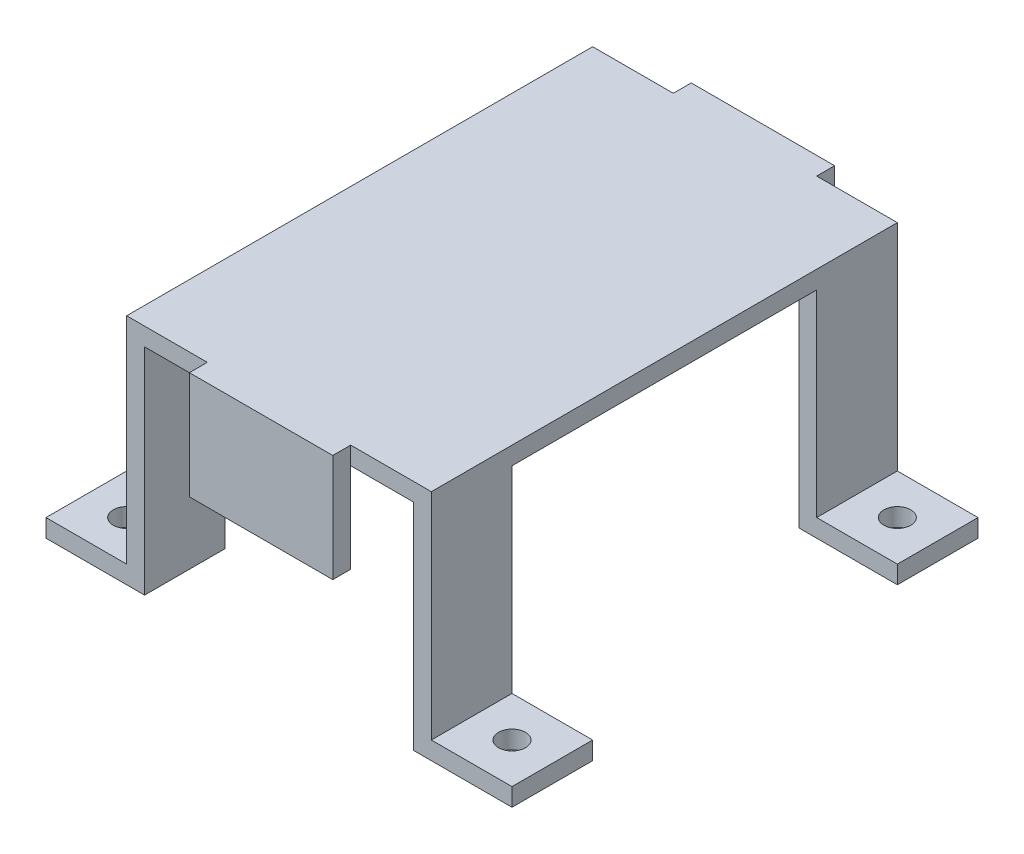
ISO-10303-21;
HEADER;
FILE_DESCRIPTION(('STEP AP214'),'2;1');
FILE_NAME('part.step','',(''),(''),'','','');
FILE_SCHEMA(('AUTOMOTIVE_DESIGN { 1 0 10303 214 1 1 1 1 }'));
ENDSEC;
DATA;
#1=APPLICATION_CONTEXT('core data for automotive mechanical design processes');
#2=APPLICATION_PROTOCOL_DEFINITION('international standard','automotive_design',2000,#1);
#3=PRODUCT_CONTEXT('',#1,'mechanical');
#4=PRODUCT('Part','Part','',(#3));
#5=PRODUCT_RELATED_PRODUCT_CATEGORY('part','',(#4));
#6=PRODUCT_DEFINITION_FORMATION('','',#4);
#7=PRODUCT_DEFINITION_CONTEXT('part definition',#1,'design');
#8=PRODUCT_DEFINITION('design','',#6,#7);
#9=PRODUCT_DEFINITION_SHAPE('','',#8);
#10=(LENGTH_UNIT() NAMED_UNIT(*) SI_UNIT(.MILLI.,.METRE.));
#11=(NAMED_UNIT(*) PLANE_ANGLE_UNIT() SI_UNIT($,.RADIAN.));
#12=(NAMED_UNIT(*) SI_UNIT($,.STERADIAN.) SOLID_ANGLE_UNIT());
#13=UNCERTAINTY_MEASURE_WITH_UNIT(LENGTH_MEASURE(1.E-05),#10,'distance_accuracy_value','');
#14=(GEOMETRIC_REPRESENTATION_CONTEXT(3) GLOBAL_UNCERTAINTY_ASSIGNED_CONTEXT((#13)) GLOBAL_UNIT_ASSIGNED_CONTEXT((#10,
#11,#12)) REPRESENTATION_CONTEXT('',''));
#15=CARTESIAN_POINT('',(0.,0.,0.));
#16=DIRECTION('',(0.,0.,1.));
#17=DIRECTION('',(1.,0.,0.));
#18=AXIS2_PLACEMENT_3D('',#15,#16,#17);
#19=CARTESIAN_POINT('',(0.,24.,0.));
#20=DIRECTION('',(0.,-1.,0.));
#21=DIRECTION('',(0.,0.,-1.));
#22=AXIS2_PLACEMENT_3D('',#19,#20,#21);
#23=PLANE('',#22);
#24=DIRECTION('',(1.,0.,0.));
#25=VECTOR('',#24,1.);
#26=CARTESIAN_POINT('',(11.,24.,-52.));
#27=LINE('',#26,#25);
#28=CARTESIAN_POINT('',(11.,24.,-52.));
#29=VERTEX_POINT('',#28);
#30=CARTESIAN_POINT('',(18.,24.,-52.));
#31=VERTEX_POINT('',#30);
#32=EDGE_CURVE('E442',#29,#31,#27,.T.);
#33=ORIENTED_EDGE('',*,*,#32,.T.);
#34=DIRECTION('',(-1.,0.,0.));
#35=VECTOR('',#34,1.);
#36=CARTESIAN_POINT('',(34.,24.,-52.));
#37=LINE('',#36,#35);
#38=CARTESIAN_POINT('',(34.,24.,-52.));
#39=VERTEX_POINT('',#38);
#40=EDGE_CURVE('E293',#39,#31,#37,.T.);
#41=ORIENTED_EDGE('',*,*,#40,.F.);
#42=CARTESIAN_POINT('',(41.,24.,-52.));
#43=VERTEX_POINT('',#42);
#44=EDGE_CURVE('E449',#39,#43,#27,.T.);
#45=ORIENTED_EDGE('',*,*,#44,.T.);
#46=DIRECTION('',(0.,0.,1.));
#47=VECTOR('',#46,1.);
#48=CARTESIAN_POINT('',(41.,24.,0.));
#49=LINE('',#48,#47);
#50=CARTESIAN_POINT('',(41.,24.,-43.));
#51=VERTEX_POINT('',#50);
#52=EDGE_CURVE('E452',#43,#51,#49,.T.);
#53=ORIENTED_EDGE('',*,*,#52,.T.);
#54=DIRECTION('',(1.,0.,0.));
#55=VECTOR('',#54,1.);
#56=CARTESIAN_POINT('',(0.,24.,-43.));
#57=LINE('',#56,#55);
#58=CARTESIAN_POINT('',(43.,24.,-43.));
#59=VERTEX_POINT('',#58);
#60=EDGE_CURVE('E393',#51,#59,#57,.T.);
#61=ORIENTED_EDGE('',*,*,#60,.T.);
#62=DIRECTION('',(0.,0.,-1.));
#63=VECTOR('',#62,1.);
#64=CARTESIAN_POINT('',(43.,24.,0.));
#65=LINE('',#64,#63);
#66=CARTESIAN_POINT('',(43.,24.,-9.));
#67=VERTEX_POINT('',#66);
#68=EDGE_CURVE('E12',#67,#59,#65,.T.);
#69=ORIENTED_EDGE('',*,*,#68,.F.);
#70=DIRECTION('',(1.,0.,0.));
#71=VECTOR('',#70,1.);
#72=CARTESIAN_POINT('',(0.,24.,-9.));
#73=LINE('',#72,#71);
#74=CARTESIAN_POINT('',(41.,24.,-9.));
#75=VERTEX_POINT('',#74);
#76=EDGE_CURVE('E387',#75,#67,#73,.T.);
#77=ORIENTED_EDGE('',*,*,#76,.F.);
#78=CARTESIAN_POINT('',(41.,24.,0.));
#79=VERTEX_POINT('',#78);
#80=EDGE_CURVE('E448',#75,#79,#49,.T.);
#81=ORIENTED_EDGE('',*,*,#80,.T.);
#82=DIRECTION('',(-1.,0.,0.));
#83=VECTOR('',#82,1.);
#84=CARTESIAN_POINT('',(11.,24.,0.));
#85=LINE('',#84,#83);
#86=CARTESIAN_POINT('',(34.,24.,0.));
#87=VERTEX_POINT('',#86);
#88=EDGE_CURVE('E457',#79,#87,#85,.T.);
#89=ORIENTED_EDGE('',*,*,#88,.T.);
#90=DIRECTION('',(1.,0.,0.));
#91=VECTOR('',#90,1.);
#92=CARTESIAN_POINT('',(34.,24.,0.));
#93=LINE('',#92,#91);
#94=CARTESIAN_POINT('',(18.,24.,0.));
#95=VERTEX_POINT('',#94);
#96=EDGE_CURVE('E325',#95,#87,#93,.T.);
#97=ORIENTED_EDGE('',*,*,#96,.F.);
#98=CARTESIAN_POINT('',(11.,24.,0.));
#99=VERTEX_POINT('',#98);
#100=EDGE_CURVE('E456',#95,#99,#85,.T.);
#101=ORIENTED_EDGE('',*,*,#100,.T.);
#102=DIRECTION('',(0.,0.,-1.));
#103=VECTOR('',#102,1.);
#104=CARTESIAN_POINT('',(11.,24.,0.));
#105=LINE('',#104,#103);
#106=CARTESIAN_POINT('',(11.,24.,-9.));
#107=VERTEX_POINT('',#106);
#108=EDGE_CURVE('E450',#99,#107,#105,.T.);
#109=ORIENTED_EDGE('',*,*,#108,.T.);
#110=CARTESIAN_POINT('',(9.,24.,-9.));
#111=VERTEX_POINT('',#110);
#112=EDGE_CURVE('E391',#111,#107,#73,.T.);
#113=ORIENTED_EDGE('',*,*,#112,.F.);
#114=DIRECTION('',(0.,0.,1.));
#115=VECTOR('',#114,1.);
#116=CARTESIAN_POINT('',(9.,24.,-52.));
#117=LINE('',#116,#115);
#118=CARTESIAN_POINT('',(9.,24.,-43.));
#119=VERTEX_POINT('',#118);
#120=EDGE_CURVE('E425',#119,#111,#117,.T.);
#121=ORIENTED_EDGE('',*,*,#120,.F.);
#122=CARTESIAN_POINT('',(11.,24.,-43.));
#123=VERTEX_POINT('',#122);
#124=EDGE_CURVE('E392',#119,#123,#57,.T.);
#125=ORIENTED_EDGE('',*,*,#124,.T.);
#126=EDGE_CURVE('E472',#123,#29,#105,.T.);
#127=ORIENTED_EDGE('',*,*,#126,.T.);
#128=EDGE_LOOP('',(#33,#41,#45,#53,#61,#69,#77,#81,#89,#97,#101,#109,#113,#121,#125,#127));
#129=FACE_BOUND('',#128,.T.);
#130=ADVANCED_FACE('F46',(#129),#23,.T.);
#131=CARTESIAN_POINT('',(0.,26.,-52.));
#132=DIRECTION('',(0.,0.,-1.));
#133=DIRECTION('',(-1.,0.,0.));
#134=AXIS2_PLACEMENT_3D('',#131,#132,#133);
#135=PLANE('',#134);
#136=DIRECTION('',(0.,-1.,0.));
#137=VECTOR('',#136,1.);
#138=CARTESIAN_POINT('',(34.,26.,-52.));
#139=LINE('',#138,#137);
#140=CARTESIAN_POINT('',(34.,26.,-52.));
#141=VERTEX_POINT('',#140);
#142=EDGE_CURVE('E62',#141,#39,#139,.T.);
#143=ORIENTED_EDGE('',*,*,#142,.F.);
#144=DIRECTION('',(1.,0.,0.));
#145=VECTOR('',#144,1.);
#146=CARTESIAN_POINT('',(0.,26.,-52.));
#147=LINE('',#146,#145);
#148=CARTESIAN_POINT('',(43.,26.,-52.));
#149=VERTEX_POINT('',#148);
#150=EDGE_CURVE('E491',#141,#149,#147,.T.);
#151=ORIENTED_EDGE('',*,*,#150,.T.);
#152=DIRECTION('',(0.,1.,0.));
#153=VECTOR('',#152,1.);
#154=CARTESIAN_POINT('',(43.,2.,-52.));
#155=LINE('',#154,#153);
#156=CARTESIAN_POINT('',(43.,2.,-52.));
#157=VERTEX_POINT('',#156);
#158=EDGE_CURVE('E671',#157,#149,#155,.T.);
#159=ORIENTED_EDGE('',*,*,#158,.F.);
#160=DIRECTION('',(-1.,0.,0.));
#161=VECTOR('',#160,1.);
#162=CARTESIAN_POINT('',(52.,2.,-52.));
#163=LINE('',#162,#161);
#164=CARTESIAN_POINT('',(52.,2.,-52.));
#165=VERTEX_POINT('',#164);
#166=EDGE_CURVE('E656',#165,#157,#163,.T.);
#167=ORIENTED_EDGE('',*,*,#166,.F.);
#168=DIRECTION('',(0.,-1.,0.));
#169=VECTOR('',#168,1.);
#170=CARTESIAN_POINT('',(52.,26.,-52.));
#171=LINE('',#170,#169);
#172=CARTESIAN_POINT('',(52.,0.,-52.));
#173=VERTEX_POINT('',#172);
#174=EDGE_CURVE('E624',#165,#173,#171,.T.);
#175=ORIENTED_EDGE('',*,*,#174,.T.);
#176=DIRECTION('',(1.,0.,0.));
#177=VECTOR('',#176,1.);
#178=CARTESIAN_POINT('',(0.,0.,-52.));
#179=LINE('',#178,#177);
#180=CARTESIAN_POINT('',(41.,0.,-52.));
#181=VERTEX_POINT('',#180);
#182=EDGE_CURVE('E500',#181,#173,#179,.T.);
#183=ORIENTED_EDGE('',*,*,#182,.F.);
#184=DIRECTION('',(0.,-1.,0.));
#185=VECTOR('',#184,1.);
#186=CARTESIAN_POINT('',(41.,24.,-52.));
#187=LINE('',#186,#185);
#188=EDGE_CURVE('E481',#43,#181,#187,.T.);
#189=ORIENTED_EDGE('',*,*,#188,.F.);
#190=ORIENTED_EDGE('',*,*,#44,.F.);
#191=EDGE_LOOP('',(#143,#151,#159,#167,#175,#183,#189,#190));
#192=FACE_BOUND('',#191,.T.);
#193=ADVANCED_FACE('F556',(#192),#135,.T.);
#194=CARTESIAN_POINT('',(0.,26.,0.));
#195=DIRECTION('',(0.,0.,-1.));
#196=DIRECTION('',(-1.,0.,0.));
#197=AXIS2_PLACEMENT_3D('',#194,#195,#196);
#198=PLANE('',#197);
#199=DIRECTION('',(0.,-1.,0.));
#200=VECTOR('',#199,1.);
#201=CARTESIAN_POINT('',(18.,26.,0.));
#202=LINE('',#201,#200);
#203=CARTESIAN_POINT('',(18.,26.,0.));
#204=VERTEX_POINT('',#203);
#205=EDGE_CURVE('E70',#204,#95,#202,.T.);
#206=ORIENTED_EDGE('',*,*,#205,.F.);
#207=DIRECTION('',(1.,0.,0.));
#208=VECTOR('',#207,1.);
#209=CARTESIAN_POINT('',(0.,26.,0.));
#210=LINE('',#209,#208);
#211=CARTESIAN_POINT('',(9.,26.,0.));
#212=VERTEX_POINT('',#211);
#213=EDGE_CURVE('E492',#212,#204,#210,.T.);
#214=ORIENTED_EDGE('',*,*,#213,.F.);
#215=DIRECTION('',(0.,1.,0.));
#216=VECTOR('',#215,1.);
#217=CARTESIAN_POINT('',(9.00000000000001,2.,0.));
#218=LINE('',#217,#216);
#219=CARTESIAN_POINT('',(9.00000000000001,2.,0.));
#220=VERTEX_POINT('',#219);
#221=EDGE_CURVE('E698',#220,#212,#218,.T.);
#222=ORIENTED_EDGE('',*,*,#221,.F.);
#223=DIRECTION('',(1.,0.,0.));
#224=VECTOR('',#223,1.);
#225=CARTESIAN_POINT('',(0.,2.,0.));
#226=LINE('',#225,#224);
#227=CARTESIAN_POINT('',(0.,2.,0.));
#228=VERTEX_POINT('',#227);
#229=EDGE_CURVE('E685',#228,#220,#226,.T.);
#230=ORIENTED_EDGE('',*,*,#229,.F.);
#231=DIRECTION('',(0.,-1.,0.));
#232=VECTOR('',#231,1.);
#233=CARTESIAN_POINT('',(0.,26.,0.));
#234=LINE('',#233,#232);
#235=CARTESIAN_POINT('',(0.,0.,0.));
#236=VERTEX_POINT('',#235);
#237=EDGE_CURVE('E634',#228,#236,#234,.T.);
#238=ORIENTED_EDGE('',*,*,#237,.T.);
#239=DIRECTION('',(1.,0.,0.));
#240=VECTOR('',#239,1.);
#241=CARTESIAN_POINT('',(0.,0.,0.));
#242=LINE('',#241,#240);
#243=CARTESIAN_POINT('',(11.,0.,0.));
#244=VERTEX_POINT('',#243);
#245=EDGE_CURVE('E723',#236,#244,#242,.T.);
#246=ORIENTED_EDGE('',*,*,#245,.T.);
#247=DIRECTION('',(0.,-1.,0.));
#248=VECTOR('',#247,1.);
#249=CARTESIAN_POINT('',(11.,24.,0.));
#250=LINE('',#249,#248);
#251=EDGE_CURVE('E473',#99,#244,#250,.T.);
#252=ORIENTED_EDGE('',*,*,#251,.F.);
#253=ORIENTED_EDGE('',*,*,#100,.F.);
#254=EDGE_LOOP('',(#206,#214,#222,#230,#238,#246,#252,#253));
#255=FACE_BOUND('',#254,.T.);
#256=ADVANCED_FACE('F564',(#255),#198,.F.);
#257=DIRECTION('',(0.,1.,0.));
#258=VECTOR('',#257,1.);
#259=CARTESIAN_POINT('',(34.,26.,0.));
#260=LINE('',#259,#258);
#261=CARTESIAN_POINT('',(34.,26.,0.));
#262=VERTEX_POINT('',#261);
#263=EDGE_CURVE('E353',#87,#262,#260,.T.);
#264=ORIENTED_EDGE('',*,*,#263,.F.);
#265=ORIENTED_EDGE('',*,*,#88,.F.);
#266=DIRECTION('',(0.,-1.,0.));
#267=VECTOR('',#266,1.);
#268=CARTESIAN_POINT('',(41.,24.,0.));
#269=LINE('',#268,#267);
#270=CARTESIAN_POINT('',(41.,0.,0.));
#271=VERTEX_POINT('',#270);
#272=EDGE_CURVE('E477',#79,#271,#269,.T.);
#273=ORIENTED_EDGE('',*,*,#272,.T.);
#274=CARTESIAN_POINT('',(52.,0.,0.));
#275=VERTEX_POINT('',#274);
#276=EDGE_CURVE('E726',#271,#275,#242,.T.);
#277=ORIENTED_EDGE('',*,*,#276,.T.);
#278=DIRECTION('',(0.,-1.,0.));
#279=VECTOR('',#278,1.);
#280=CARTESIAN_POINT('',(52.,26.,0.));
#281=LINE('',#280,#279);
#282=CARTESIAN_POINT('',(52.,2.,0.));
#283=VERTEX_POINT('',#282);
#284=EDGE_CURVE('E628',#283,#275,#281,.T.);
#285=ORIENTED_EDGE('',*,*,#284,.F.);
#286=DIRECTION('',(1.,0.,0.));
#287=VECTOR('',#286,1.);
#288=CARTESIAN_POINT('',(52.,2.,0.));
#289=LINE('',#288,#287);
#290=CARTESIAN_POINT('',(43.,2.,0.));
#291=VERTEX_POINT('',#290);
#292=EDGE_CURVE('E654',#291,#283,#289,.T.);
#293=ORIENTED_EDGE('',*,*,#292,.F.);
#294=DIRECTION('',(0.,1.,0.));
#295=VECTOR('',#294,1.);
#296=CARTESIAN_POINT('',(43.,2.,0.));
#297=LINE('',#296,#295);
#298=CARTESIAN_POINT('',(43.,26.,0.));
#299=VERTEX_POINT('',#298);
#300=EDGE_CURVE('E676',#291,#299,#297,.T.);
#301=ORIENTED_EDGE('',*,*,#300,.T.);
#302=EDGE_CURVE('E490',#262,#299,#210,.T.);
#303=ORIENTED_EDGE('',*,*,#302,.F.);
#304=EDGE_LOOP('',(#264,#265,#273,#277,#285,#293,#301,#303));
#305=FACE_BOUND('',#304,.T.);
#306=ADVANCED_FACE('F586',(#305),#198,.F.);
#307=CARTESIAN_POINT('',(0.,26.,0.));
#308=DIRECTION('',(-1.,0.,0.));
#309=DIRECTION('',(0.,0.,1.));
#310=AXIS2_PLACEMENT_3D('',#307,#308,#309);
#311=PLANE('',#310);
#312=DIRECTION('',(0.,-1.,0.));
#313=VECTOR('',#312,1.);
#314=CARTESIAN_POINT('',(0.,0.,-9.));
#315=LINE('',#314,#313);
#316=CARTESIAN_POINT('',(0.,2.,-9.));
#317=VERTEX_POINT('',#316);
#318=CARTESIAN_POINT('',(0.,0.,-9.));
#319=VERTEX_POINT('',#318);
#320=EDGE_CURVE('E373',#317,#319,#315,.T.);
#321=ORIENTED_EDGE('',*,*,#320,.T.);
#322=DIRECTION('',(0.,0.,-1.));
#323=VECTOR('',#322,1.);
#324=CARTESIAN_POINT('',(0.,0.,0.));
#325=LINE('',#324,#323);
#326=EDGE_CURVE('E496',#236,#319,#325,.T.);
#327=ORIENTED_EDGE('',*,*,#326,.F.);
#328=ORIENTED_EDGE('',*,*,#237,.F.);
#329=DIRECTION('',(0.,0.,1.));
#330=VECTOR('',#329,1.);
#331=CARTESIAN_POINT('',(0.,2.,-52.));
#332=LINE('',#331,#330);
#333=EDGE_CURVE('E686',#317,#228,#332,.T.);
#334=ORIENTED_EDGE('',*,*,#333,.F.);
#335=EDGE_LOOP('',(#321,#327,#328,#334));
#336=FACE_BOUND('',#335,.T.);
#337=ADVANCED_FACE('F829',(#336),#311,.T.);
#338=CARTESIAN_POINT('',(52.,26.,0.));
#339=DIRECTION('',(-1.,0.,0.));
#340=DIRECTION('',(0.,0.,1.));
#341=AXIS2_PLACEMENT_3D('',#338,#339,#340);
#342=PLANE('',#341);
#343=DIRECTION('',(0.,0.,-1.));
#344=VECTOR('',#343,1.);
#345=CARTESIAN_POINT('',(52.,0.,0.));
#346=LINE('',#345,#344);
#347=CARTESIAN_POINT('',(52.,0.,-9.));
#348=VERTEX_POINT('',#347);
#349=EDGE_CURVE('E507',#275,#348,#346,.T.);
#350=ORIENTED_EDGE('',*,*,#349,.T.);
#351=DIRECTION('',(0.,-1.,0.));
#352=VECTOR('',#351,1.);
#353=CARTESIAN_POINT('',(52.,0.,-9.));
#354=LINE('',#353,#352);
#355=CARTESIAN_POINT('',(52.,2.,-9.));
#356=VERTEX_POINT('',#355);
#357=EDGE_CURVE('E372',#356,#348,#354,.T.);
#358=ORIENTED_EDGE('',*,*,#357,.F.);
#359=DIRECTION('',(0.,0.,-1.));
#360=VECTOR('',#359,1.);
#361=CARTESIAN_POINT('',(52.,2.,0.));
#362=LINE('',#361,#360);
#363=EDGE_CURVE('E649',#283,#356,#362,.T.);
#364=ORIENTED_EDGE('',*,*,#363,.F.);
#365=ORIENTED_EDGE('',*,*,#284,.T.);
#366=EDGE_LOOP('',(#350,#358,#364,#365));
#367=FACE_BOUND('',#366,.T.);
#368=ADVANCED_FACE('F590',(#367),#342,.F.);
#369=CARTESIAN_POINT('',(0.,0.,0.));
#370=DIRECTION('',(0.,-1.,0.));
#371=DIRECTION('',(0.,0.,-1.));
#372=AXIS2_PLACEMENT_3D('',#369,#370,#371);
#373=PLANE('',#372);
#374=DIRECTION('',(1.,0.,0.));
#375=VECTOR('',#374,1.);
#376=CARTESIAN_POINT('',(0.,0.,-9.));
#377=LINE('',#376,#375);
#378=CARTESIAN_POINT('',(11.,0.,-9.));
#379=VERTEX_POINT('',#378);
#380=EDGE_CURVE('E401',#319,#379,#377,.T.);
#381=ORIENTED_EDGE('',*,*,#380,.T.);
#382=DIRECTION('',(0.,0.,-1.));
#383=VECTOR('',#382,1.);
#384=CARTESIAN_POINT('',(11.,0.,0.));
#385=LINE('',#384,#383);
#386=EDGE_CURVE('E461',#244,#379,#385,.T.);
#387=ORIENTED_EDGE('',*,*,#386,.F.);
#388=ORIENTED_EDGE('',*,*,#245,.F.);
#389=ORIENTED_EDGE('',*,*,#326,.T.);
#390=EDGE_LOOP('',(#381,#387,#388,#389));
#391=FACE_BOUND('',#390,.T.);
#392=CARTESIAN_POINT('',(4.5,0.,-4.5));
#393=DIRECTION('',(0.,1.,0.));
#394=DIRECTION('',(0.,0.,1.));
#395=AXIS2_PLACEMENT_3D('',#392,#393,#394);
#396=CIRCLE('',#395,1.5);
#397=CARTESIAN_POINT('',(4.5,0.,-3.));
#398=VERTEX_POINT('',#397);
#399=EDGE_CURVE('E414',#398,#398,#396,.T.);
#400=ORIENTED_EDGE('',*,*,#399,.T.);
#401=EDGE_LOOP('',(#400));
#402=FACE_BOUND('',#401,.T.);
#403=ADVANCED_FACE('F582',(#391,#402),#373,.T.);
#404=CARTESIAN_POINT('',(41.,0.,-9.));
#405=VERTEX_POINT('',#404);
#406=EDGE_CURVE('E382',#405,#348,#377,.T.);
#407=ORIENTED_EDGE('',*,*,#406,.T.);
#408=ORIENTED_EDGE('',*,*,#349,.F.);
#409=ORIENTED_EDGE('',*,*,#276,.F.);
#410=DIRECTION('',(0.,0.,1.));
#411=VECTOR('',#410,1.);
#412=CARTESIAN_POINT('',(41.,0.,0.));
#413=LINE('',#412,#411);
#414=EDGE_CURVE('E465',#405,#271,#413,.T.);
#415=ORIENTED_EDGE('',*,*,#414,.F.);
#416=EDGE_LOOP('',(#407,#408,#409,#415));
#417=FACE_BOUND('',#416,.T.);
#418=CARTESIAN_POINT('',(47.5,0.,-4.5));
#419=DIRECTION('',(0.,1.,0.));
#420=DIRECTION('',(0.,0.,1.));
#421=AXIS2_PLACEMENT_3D('',#418,#419,#420);
#422=CIRCLE('',#421,1.5);
#423=CARTESIAN_POINT('',(47.5,0.,-2.99999999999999));
#424=VERTEX_POINT('',#423);
#425=EDGE_CURVE('E426',#424,#424,#422,.T.);
#426=ORIENTED_EDGE('',*,*,#425,.T.);
#427=EDGE_LOOP('',(#426));
#428=FACE_BOUND('',#427,.T.);
#429=ADVANCED_FACE('F598',(#417,#428),#373,.T.);
#430=CARTESIAN_POINT('',(11.,24.,0.));
#431=DIRECTION('',(-1.,0.,0.));
#432=DIRECTION('',(0.,0.,1.));
#433=AXIS2_PLACEMENT_3D('',#430,#431,#432);
#434=PLANE('',#433);
#435=ORIENTED_EDGE('',*,*,#386,.T.);
#436=DIRECTION('',(0.,1.,0.));
#437=VECTOR('',#436,1.);
#438=CARTESIAN_POINT('',(11.,24.,-9.));
#439=LINE('',#438,#437);
#440=EDGE_CURVE('E847',#379,#107,#439,.T.);
#441=ORIENTED_EDGE('',*,*,#440,.T.);
#442=ORIENTED_EDGE('',*,*,#108,.F.);
#443=ORIENTED_EDGE('',*,*,#251,.T.);
#444=EDGE_LOOP('',(#435,#441,#442,#443));
#445=FACE_BOUND('',#444,.T.);
#446=ADVANCED_FACE('F575',(#445),#434,.F.);
#447=CARTESIAN_POINT('',(41.,24.,0.));
#448=DIRECTION('',(1.,0.,0.));
#449=DIRECTION('',(0.,0.,-1.));
#450=AXIS2_PLACEMENT_3D('',#447,#448,#449);
#451=PLANE('',#450);
#452=ORIENTED_EDGE('',*,*,#80,.F.);
#453=DIRECTION('',(0.,-1.,0.));
#454=VECTOR('',#453,1.);
#455=CARTESIAN_POINT('',(41.,24.,-9.));
#456=LINE('',#455,#454);
#457=EDGE_CURVE('E856',#75,#405,#456,.T.);
#458=ORIENTED_EDGE('',*,*,#457,.T.);
#459=ORIENTED_EDGE('',*,*,#414,.T.);
#460=ORIENTED_EDGE('',*,*,#272,.F.);
#461=EDGE_LOOP('',(#452,#458,#459,#460));
#462=FACE_BOUND('',#461,.T.);
#463=ADVANCED_FACE('F553',(#462),#451,.F.);
#464=CARTESIAN_POINT('',(0.,2.,0.));
#465=DIRECTION('',(0.,1.,0.));
#466=DIRECTION('',(0.,0.,1.));
#467=AXIS2_PLACEMENT_3D('',#464,#465,#466);
#468=PLANE('',#467);
#469=DIRECTION('',(1.,0.,0.));
#470=VECTOR('',#469,1.);
#471=CARTESIAN_POINT('',(0.,2.,-9.));
#472=LINE('',#471,#470);
#473=CARTESIAN_POINT('',(9.00000000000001,2.,-9.));
#474=VERTEX_POINT('',#473);
#475=EDGE_CURVE('E863',#317,#474,#472,.T.);
#476=ORIENTED_EDGE('',*,*,#475,.F.);
#477=ORIENTED_EDGE('',*,*,#333,.T.);
#478=ORIENTED_EDGE('',*,*,#229,.T.);
#479=DIRECTION('',(0.,0.,-1.));
#480=VECTOR('',#479,1.);
#481=CARTESIAN_POINT('',(9.,2.,-52.));
#482=LINE('',#481,#480);
#483=EDGE_CURVE('E691',#220,#474,#482,.T.);
#484=ORIENTED_EDGE('',*,*,#483,.T.);
#485=EDGE_LOOP('',(#476,#477,#478,#484));
#486=FACE_BOUND('',#485,.T.);
#487=CARTESIAN_POINT('',(4.5,2.,-4.5));
#488=DIRECTION('',(0.,1.,0.));
#489=DIRECTION('',(0.,0.,1.));
#490=AXIS2_PLACEMENT_3D('',#487,#488,#489);
#491=CIRCLE('',#490,1.5);
#492=CARTESIAN_POINT('',(4.5,2.,-3.));
#493=VERTEX_POINT('',#492);
#494=EDGE_CURVE('E421',#493,#493,#491,.T.);
#495=ORIENTED_EDGE('',*,*,#494,.F.);
#496=EDGE_LOOP('',(#495));
#497=FACE_BOUND('',#496,.T.);
#498=ADVANCED_FACE('F539',(#486,#497),#468,.T.);
#499=CARTESIAN_POINT('',(0.,2.,0.));
#500=DIRECTION('',(0.,1.,0.));
#501=DIRECTION('',(0.,0.,1.));
#502=AXIS2_PLACEMENT_3D('',#499,#500,#501);
#503=PLANE('',#502);
#504=DIRECTION('',(1.,0.,0.));
#505=VECTOR('',#504,1.);
#506=CARTESIAN_POINT('',(0.,2.,-9.));
#507=LINE('',#506,#505);
#508=CARTESIAN_POINT('',(43.,2.,-9.));
#509=VERTEX_POINT('',#508);
#510=EDGE_CURVE('E55',#509,#356,#507,.T.);
#511=ORIENTED_EDGE('',*,*,#510,.F.);
#512=DIRECTION('',(0.,0.,1.));
#513=VECTOR('',#512,1.);
#514=CARTESIAN_POINT('',(43.,2.,0.));
#515=LINE('',#514,#513);
#516=EDGE_CURVE('E661',#509,#291,#515,.T.);
#517=ORIENTED_EDGE('',*,*,#516,.T.);
#518=ORIENTED_EDGE('',*,*,#292,.T.);
#519=ORIENTED_EDGE('',*,*,#363,.T.);
#520=EDGE_LOOP('',(#511,#517,#518,#519));
#521=FACE_BOUND('',#520,.T.);
#522=CARTESIAN_POINT('',(47.5,2.,-4.5));
#523=DIRECTION('',(0.,1.,0.));
#524=DIRECTION('',(0.,0.,1.));
#525=AXIS2_PLACEMENT_3D('',#522,#523,#524);
#526=CIRCLE('',#525,1.5);
#527=CARTESIAN_POINT('',(47.5,2.,-2.99999999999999));
#528=VERTEX_POINT('',#527);
#529=EDGE_CURVE('E432',#528,#528,#526,.T.);
#530=ORIENTED_EDGE('',*,*,#529,.F.);
#531=EDGE_LOOP('',(#530));
#532=FACE_BOUND('',#531,.T.);
#533=ADVANCED_FACE('F552',(#521,#532),#503,.T.);
#534=DIRECTION('',(0.,1.,0.));
#535=VECTOR('',#534,1.);
#536=CARTESIAN_POINT('',(0.,0.,-43.));
#537=LINE('',#536,#535);
#538=CARTESIAN_POINT('',(0.,0.,-43.));
#539=VERTEX_POINT('',#538);
#540=CARTESIAN_POINT('',(0.,2.,-43.));
#541=VERTEX_POINT('',#540);
#542=EDGE_CURVE('E377',#539,#541,#537,.T.);
#543=ORIENTED_EDGE('',*,*,#542,.T.);
#544=CARTESIAN_POINT('',(0.,2.,-52.));
#545=VERTEX_POINT('',#544);
#546=EDGE_CURVE('E621',#545,#541,#332,.T.);
#547=ORIENTED_EDGE('',*,*,#546,.F.);
#548=DIRECTION('',(0.,-1.,0.));
#549=VECTOR('',#548,1.);
#550=CARTESIAN_POINT('',(0.,26.,-52.));
#551=LINE('',#550,#549);
#552=CARTESIAN_POINT('',(0.,0.,-52.));
#553=VERTEX_POINT('',#552);
#554=EDGE_CURVE('E495',#545,#553,#551,.T.);
#555=ORIENTED_EDGE('',*,*,#554,.T.);
#556=EDGE_CURVE('E476',#539,#553,#325,.T.);
#557=ORIENTED_EDGE('',*,*,#556,.F.);
#558=EDGE_LOOP('',(#543,#547,#555,#557));
#559=FACE_BOUND('',#558,.T.);
#560=ADVANCED_FACE('F48',(#559),#311,.T.);
#561=CARTESIAN_POINT('',(52.,2.,-43.));
#562=VERTEX_POINT('',#561);
#563=EDGE_CURVE('E657',#562,#165,#362,.T.);
#564=ORIENTED_EDGE('',*,*,#563,.F.);
#565=DIRECTION('',(0.,1.,0.));
#566=VECTOR('',#565,1.);
#567=CARTESIAN_POINT('',(52.,0.,-43.));
#568=LINE('',#567,#566);
#569=CARTESIAN_POINT('',(52.,0.,-43.));
#570=VERTEX_POINT('',#569);
#571=EDGE_CURVE('E378',#570,#562,#568,.T.);
#572=ORIENTED_EDGE('',*,*,#571,.F.);
#573=EDGE_CURVE('E506',#570,#173,#346,.T.);
#574=ORIENTED_EDGE('',*,*,#573,.T.);
#575=ORIENTED_EDGE('',*,*,#174,.F.);
#576=EDGE_LOOP('',(#564,#572,#574,#575));
#577=FACE_BOUND('',#576,.T.);
#578=ADVANCED_FACE('F587',(#577),#342,.F.);
#579=DIRECTION('',(1.,0.,0.));
#580=VECTOR('',#579,1.);
#581=CARTESIAN_POINT('',(0.,0.,-43.));
#582=LINE('',#581,#580);
#583=CARTESIAN_POINT('',(11.,0.,-43.));
#584=VERTEX_POINT('',#583);
#585=EDGE_CURVE('E397',#539,#584,#582,.T.);
#586=ORIENTED_EDGE('',*,*,#585,.F.);
#587=ORIENTED_EDGE('',*,*,#556,.T.);
#588=CARTESIAN_POINT('',(11.,0.,-52.));
#589=VERTEX_POINT('',#588);
#590=EDGE_CURVE('E501',#553,#589,#179,.T.);
#591=ORIENTED_EDGE('',*,*,#590,.T.);
#592=EDGE_CURVE('E466',#584,#589,#385,.T.);
#593=ORIENTED_EDGE('',*,*,#592,.F.);
#594=EDGE_LOOP('',(#586,#587,#591,#593));
#595=FACE_BOUND('',#594,.T.);
#596=CARTESIAN_POINT('',(4.5,0.,-47.5));
#597=DIRECTION('',(0.,1.,0.));
#598=DIRECTION('',(0.,0.,1.));
#599=AXIS2_PLACEMENT_3D('',#596,#597,#598);
#600=CIRCLE('',#599,1.5);
#601=CARTESIAN_POINT('',(4.5,0.,-46.));
#602=VERTEX_POINT('',#601);
#603=EDGE_CURVE('E521',#602,#602,#600,.T.);
#604=ORIENTED_EDGE('',*,*,#603,.T.);
#605=EDGE_LOOP('',(#604));
#606=FACE_BOUND('',#605,.T.);
#607=ADVANCED_FACE('F583',(#595,#606),#373,.T.);
#608=DIRECTION('',(0.,1.,0.));
#609=VECTOR('',#608,1.);
#610=CARTESIAN_POINT('',(18.,26.,-52.));
#611=LINE('',#610,#609);
#612=CARTESIAN_POINT('',(18.,26.,-52.));
#613=VERTEX_POINT('',#612);
#614=EDGE_CURVE('E301',#31,#613,#611,.T.);
#615=ORIENTED_EDGE('',*,*,#614,.F.);
#616=ORIENTED_EDGE('',*,*,#32,.F.);
#617=DIRECTION('',(0.,-1.,0.));
#618=VECTOR('',#617,1.);
#619=CARTESIAN_POINT('',(11.,24.,-52.));
#620=LINE('',#619,#618);
#621=EDGE_CURVE('E460',#29,#589,#620,.T.);
#622=ORIENTED_EDGE('',*,*,#621,.T.);
#623=ORIENTED_EDGE('',*,*,#590,.F.);
#624=ORIENTED_EDGE('',*,*,#554,.F.);
#625=DIRECTION('',(-1.,0.,0.));
#626=VECTOR('',#625,1.);
#627=CARTESIAN_POINT('',(0.,2.,-52.));
#628=LINE('',#627,#626);
#629=CARTESIAN_POINT('',(9.,2.,-52.));
#630=VERTEX_POINT('',#629);
#631=EDGE_CURVE('E695',#630,#545,#628,.T.);
#632=ORIENTED_EDGE('',*,*,#631,.F.);
#633=DIRECTION('',(0.,1.,0.));
#634=VECTOR('',#633,1.);
#635=CARTESIAN_POINT('',(9.,2.,-52.));
#636=LINE('',#635,#634);
#637=CARTESIAN_POINT('',(9.,26.,-52.));
#638=VERTEX_POINT('',#637);
#639=EDGE_CURVE('E675',#630,#638,#636,.T.);
#640=ORIENTED_EDGE('',*,*,#639,.T.);
#641=EDGE_CURVE('E487',#638,#613,#147,.T.);
#642=ORIENTED_EDGE('',*,*,#641,.T.);
#643=EDGE_LOOP('',(#615,#616,#622,#623,#624,#632,#640,#642));
#644=FACE_BOUND('',#643,.T.);
#645=ADVANCED_FACE('F565',(#644),#135,.T.);
#646=CARTESIAN_POINT('',(0.,26.,0.));
#647=DIRECTION('',(0.,-1.,0.));
#648=DIRECTION('',(0.,0.,-1.));
#649=AXIS2_PLACEMENT_3D('',#646,#647,#648);
#650=PLANE('',#649);
#651=ORIENTED_EDGE('',*,*,#213,.T.);
#652=DIRECTION('',(0.,0.,-1.));
#653=VECTOR('',#652,1.);
#654=CARTESIAN_POINT('',(18.,26.,2.));
#655=LINE('',#654,#653);
#656=CARTESIAN_POINT('',(18.,26.,2.));
#657=VERTEX_POINT('',#656);
#658=EDGE_CURVE('E359',#657,#204,#655,.T.);
#659=ORIENTED_EDGE('',*,*,#658,.F.);
#660=DIRECTION('',(-1.,0.,0.));
#661=VECTOR('',#660,1.);
#662=CARTESIAN_POINT('',(18.,26.,2.));
#663=LINE('',#662,#661);
#664=CARTESIAN_POINT('',(34.,26.,2.));
#665=VERTEX_POINT('',#664);
#666=EDGE_CURVE('E356',#665,#657,#663,.T.);
#667=ORIENTED_EDGE('',*,*,#666,.F.);
#668=DIRECTION('',(0.,0.,-1.));
#669=VECTOR('',#668,1.);
#670=CARTESIAN_POINT('',(34.,26.,2.));
#671=LINE('',#670,#669);
#672=EDGE_CURVE('E368',#665,#262,#671,.T.);
#673=ORIENTED_EDGE('',*,*,#672,.T.);
#674=ORIENTED_EDGE('',*,*,#302,.T.);
#675=DIRECTION('',(0.,0.,1.));
#676=VECTOR('',#675,1.);
#677=CARTESIAN_POINT('',(43.,26.,0.));
#678=LINE('',#677,#676);
#679=EDGE_CURVE('E663',#149,#299,#678,.T.);
#680=ORIENTED_EDGE('',*,*,#679,.F.);
#681=ORIENTED_EDGE('',*,*,#150,.F.);
#682=DIRECTION('',(0.,0.,1.));
#683=VECTOR('',#682,1.);
#684=CARTESIAN_POINT('',(34.,26.,-54.));
#685=LINE('',#684,#683);
#686=CARTESIAN_POINT('',(34.,26.,-54.));
#687=VERTEX_POINT('',#686);
#688=EDGE_CURVE('E314',#687,#141,#685,.T.);
#689=ORIENTED_EDGE('',*,*,#688,.F.);
#690=DIRECTION('',(1.,0.,0.));
#691=VECTOR('',#690,1.);
#692=CARTESIAN_POINT('',(34.,26.,-54.));
#693=LINE('',#692,#691);
#694=CARTESIAN_POINT('',(18.,26.,-54.));
#695=VERTEX_POINT('',#694);
#696=EDGE_CURVE('E312',#695,#687,#693,.T.);
#697=ORIENTED_EDGE('',*,*,#696,.F.);
#698=DIRECTION('',(0.,0.,1.));
#699=VECTOR('',#698,1.);
#700=CARTESIAN_POINT('',(18.,26.,-54.));
#701=LINE('',#700,#699);
#702=EDGE_CURVE('E321',#695,#613,#701,.T.);
#703=ORIENTED_EDGE('',*,*,#702,.T.);
#704=ORIENTED_EDGE('',*,*,#641,.F.);
#705=DIRECTION('',(0.,0.,-1.));
#706=VECTOR('',#705,1.);
#707=CARTESIAN_POINT('',(9.,26.,-52.));
#708=LINE('',#707,#706);
#709=EDGE_CURVE('E431',#212,#638,#708,.T.);
#710=ORIENTED_EDGE('',*,*,#709,.F.);
#711=EDGE_LOOP('',(#651,#659,#667,#673,#674,#680,#681,#689,#697,#703,#704,#710));
#712=FACE_BOUND('',#711,.T.);
#713=ADVANCED_FACE('F576',(#712),#650,.F.);
#714=CARTESIAN_POINT('',(41.,0.,-43.));
#715=VERTEX_POINT('',#714);
#716=EDGE_CURVE('E400',#715,#570,#582,.T.);
#717=ORIENTED_EDGE('',*,*,#716,.F.);
#718=EDGE_CURVE('E467',#181,#715,#413,.T.);
#719=ORIENTED_EDGE('',*,*,#718,.F.);
#720=ORIENTED_EDGE('',*,*,#182,.T.);
#721=ORIENTED_EDGE('',*,*,#573,.F.);
#722=EDGE_LOOP('',(#717,#719,#720,#721));
#723=FACE_BOUND('',#722,.T.);
#724=CARTESIAN_POINT('',(47.5,0.,-47.5));
#725=DIRECTION('',(0.,1.,0.));
#726=DIRECTION('',(0.,0.,1.));
#727=AXIS2_PLACEMENT_3D('',#724,#725,#726);
#728=CIRCLE('',#727,1.5);
#729=CARTESIAN_POINT('',(47.5,0.,-46.));
#730=VERTEX_POINT('',#729);
#731=EDGE_CURVE('E510',#730,#730,#728,.T.);
#732=ORIENTED_EDGE('',*,*,#731,.T.);
#733=EDGE_LOOP('',(#732));
#734=FACE_BOUND('',#733,.T.);
#735=ADVANCED_FACE('F573',(#723,#734),#373,.T.);
#736=ORIENTED_EDGE('',*,*,#126,.F.);
#737=DIRECTION('',(0.,-1.,0.));
#738=VECTOR('',#737,1.);
#739=CARTESIAN_POINT('',(11.,24.,-43.));
#740=LINE('',#739,#738);
#741=EDGE_CURVE('E868',#123,#584,#740,.T.);
#742=ORIENTED_EDGE('',*,*,#741,.T.);
#743=ORIENTED_EDGE('',*,*,#592,.T.);
#744=ORIENTED_EDGE('',*,*,#621,.F.);
#745=EDGE_LOOP('',(#736,#742,#743,#744));
#746=FACE_BOUND('',#745,.T.);
#747=ADVANCED_FACE('F569',(#746),#434,.F.);
#748=ORIENTED_EDGE('',*,*,#718,.T.);
#749=DIRECTION('',(0.,1.,0.));
#750=VECTOR('',#749,1.);
#751=CARTESIAN_POINT('',(41.,24.,-43.));
#752=LINE('',#751,#750);
#753=EDGE_CURVE('E870',#715,#51,#752,.T.);
#754=ORIENTED_EDGE('',*,*,#753,.T.);
#755=ORIENTED_EDGE('',*,*,#52,.F.);
#756=ORIENTED_EDGE('',*,*,#188,.T.);
#757=EDGE_LOOP('',(#748,#754,#755,#756));
#758=FACE_BOUND('',#757,.T.);
#759=ADVANCED_FACE('F547',(#758),#451,.F.);
#760=CARTESIAN_POINT('',(9.,2.,-52.));
#761=DIRECTION('',(1.,0.,0.));
#762=DIRECTION('',(0.,0.,-1.));
#763=AXIS2_PLACEMENT_3D('',#760,#761,#762);
#764=PLANE('',#763);
#765=ORIENTED_EDGE('',*,*,#120,.T.);
#766=DIRECTION('',(0.,-1.,0.));
#767=VECTOR('',#766,1.);
#768=CARTESIAN_POINT('',(9.00000000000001,2.,-9.));
#769=LINE('',#768,#767);
#770=EDGE_CURVE('E851',#111,#474,#769,.T.);
#771=ORIENTED_EDGE('',*,*,#770,.T.);
#772=ORIENTED_EDGE('',*,*,#483,.F.);
#773=ORIENTED_EDGE('',*,*,#221,.T.);
#774=ORIENTED_EDGE('',*,*,#709,.T.);
#775=ORIENTED_EDGE('',*,*,#639,.F.);
#776=CARTESIAN_POINT('',(9.,2.,-43.));
#777=VERTEX_POINT('',#776);
#778=EDGE_CURVE('E690',#777,#630,#482,.T.);
#779=ORIENTED_EDGE('',*,*,#778,.F.);
#780=DIRECTION('',(0.,1.,0.));
#781=VECTOR('',#780,1.);
#782=CARTESIAN_POINT('',(9.,2.,-43.));
#783=LINE('',#782,#781);
#784=EDGE_CURVE('E853',#777,#119,#783,.T.);
#785=ORIENTED_EDGE('',*,*,#784,.T.);
#786=EDGE_LOOP('',(#765,#771,#772,#773,#774,#775,#779,#785));
#787=FACE_BOUND('',#786,.T.);
#788=ADVANCED_FACE('F536',(#787),#764,.F.);
#789=DIRECTION('',(-1.,0.,0.));
#790=VECTOR('',#789,1.);
#791=CARTESIAN_POINT('',(0.,2.,-43.));
#792=LINE('',#791,#790);
#793=EDGE_CURVE('E876',#777,#541,#792,.T.);
#794=ORIENTED_EDGE('',*,*,#793,.F.);
#795=ORIENTED_EDGE('',*,*,#778,.T.);
#796=ORIENTED_EDGE('',*,*,#631,.T.);
#797=ORIENTED_EDGE('',*,*,#546,.T.);
#798=EDGE_LOOP('',(#794,#795,#796,#797));
#799=FACE_BOUND('',#798,.T.);
#800=CARTESIAN_POINT('',(4.5,2.,-47.5));
#801=DIRECTION('',(0.,1.,0.));
#802=DIRECTION('',(0.,0.,1.));
#803=AXIS2_PLACEMENT_3D('',#800,#801,#802);
#804=CIRCLE('',#803,1.5);
#805=CARTESIAN_POINT('',(4.5,2.,-46.));
#806=VERTEX_POINT('',#805);
#807=EDGE_CURVE('E420',#806,#806,#804,.T.);
#808=ORIENTED_EDGE('',*,*,#807,.F.);
#809=EDGE_LOOP('',(#808));
#810=FACE_BOUND('',#809,.T.);
#811=ADVANCED_FACE('F533',(#799,#810),#468,.T.);
#812=CARTESIAN_POINT('',(43.,2.,0.));
#813=DIRECTION('',(-1.,0.,0.));
#814=DIRECTION('',(0.,0.,1.));
#815=AXIS2_PLACEMENT_3D('',#812,#813,#814);
#816=PLANE('',#815);
#817=ORIENTED_EDGE('',*,*,#516,.F.);
#818=DIRECTION('',(0.,1.,0.));
#819=VECTOR('',#818,1.);
#820=CARTESIAN_POINT('',(43.,2.,-9.));
#821=LINE('',#820,#819);
#822=EDGE_CURVE('E642',#509,#67,#821,.T.);
#823=ORIENTED_EDGE('',*,*,#822,.T.);
#824=ORIENTED_EDGE('',*,*,#68,.T.);
#825=DIRECTION('',(0.,-1.,0.));
#826=VECTOR('',#825,1.);
#827=CARTESIAN_POINT('',(43.,2.,-43.));
#828=LINE('',#827,#826);
#829=CARTESIAN_POINT('',(43.,2.,-43.));
#830=VERTEX_POINT('',#829);
#831=EDGE_CURVE('E406',#59,#830,#828,.T.);
#832=ORIENTED_EDGE('',*,*,#831,.T.);
#833=EDGE_CURVE('E665',#157,#830,#515,.T.);
#834=ORIENTED_EDGE('',*,*,#833,.F.);
#835=ORIENTED_EDGE('',*,*,#158,.T.);
#836=ORIENTED_EDGE('',*,*,#679,.T.);
#837=ORIENTED_EDGE('',*,*,#300,.F.);
#838=EDGE_LOOP('',(#817,#823,#824,#832,#834,#835,#836,#837));
#839=FACE_BOUND('',#838,.T.);
#840=ADVANCED_FACE('F535',(#839),#816,.F.);
#841=DIRECTION('',(-1.,0.,0.));
#842=VECTOR('',#841,1.);
#843=CARTESIAN_POINT('',(0.,2.,-43.));
#844=LINE('',#843,#842);
#845=EDGE_CURVE('E632',#562,#830,#844,.T.);
#846=ORIENTED_EDGE('',*,*,#845,.F.);
#847=ORIENTED_EDGE('',*,*,#563,.T.);
#848=ORIENTED_EDGE('',*,*,#166,.T.);
#849=ORIENTED_EDGE('',*,*,#833,.T.);
#850=EDGE_LOOP('',(#846,#847,#848,#849));
#851=FACE_BOUND('',#850,.T.);
#852=CARTESIAN_POINT('',(47.5,2.,-47.5));
#853=DIRECTION('',(0.,1.,0.));
#854=DIRECTION('',(0.,0.,1.));
#855=AXIS2_PLACEMENT_3D('',#852,#853,#854);
#856=CIRCLE('',#855,1.5);
#857=CARTESIAN_POINT('',(47.5,2.,-46.));
#858=VERTEX_POINT('',#857);
#859=EDGE_CURVE('E516',#858,#858,#856,.T.);
#860=ORIENTED_EDGE('',*,*,#859,.F.);
#861=EDGE_LOOP('',(#860));
#862=FACE_BOUND('',#861,.T.);
#863=ADVANCED_FACE('F544',(#851,#862),#503,.T.);
#864=CARTESIAN_POINT('',(47.5,0.,-4.5));
#865=DIRECTION('',(0.,1.,0.));
#866=DIRECTION('',(0.,0.,1.));
#867=AXIS2_PLACEMENT_3D('',#864,#865,#866);
#868=CYLINDRICAL_SURFACE('',#867,1.5);
#869=ORIENTED_EDGE('',*,*,#425,.F.);
#870=EDGE_LOOP('',(#869));
#871=FACE_BOUND('',#870,.T.);
#872=ORIENTED_EDGE('',*,*,#529,.T.);
#873=EDGE_LOOP('',(#872));
#874=FACE_BOUND('',#873,.T.);
#875=ADVANCED_FACE('F807',(#871,#874),#868,.F.);
#876=CARTESIAN_POINT('',(47.5,0.,-47.5));
#877=DIRECTION('',(0.,1.,0.));
#878=DIRECTION('',(0.,0.,1.));
#879=AXIS2_PLACEMENT_3D('',#876,#877,#878);
#880=CYLINDRICAL_SURFACE('',#879,1.5);
#881=ORIENTED_EDGE('',*,*,#731,.F.);
#882=EDGE_LOOP('',(#881));
#883=FACE_BOUND('',#882,.T.);
#884=ORIENTED_EDGE('',*,*,#859,.T.);
#885=EDGE_LOOP('',(#884));
#886=FACE_BOUND('',#885,.T.);
#887=ADVANCED_FACE('F804',(#883,#886),#880,.F.);
#888=CARTESIAN_POINT('',(4.5,0.,-47.5));
#889=DIRECTION('',(0.,1.,0.));
#890=DIRECTION('',(0.,0.,1.));
#891=AXIS2_PLACEMENT_3D('',#888,#889,#890);
#892=CYLINDRICAL_SURFACE('',#891,1.5);
#893=ORIENTED_EDGE('',*,*,#603,.F.);
#894=EDGE_LOOP('',(#893));
#895=FACE_BOUND('',#894,.T.);
#896=ORIENTED_EDGE('',*,*,#807,.T.);
#897=EDGE_LOOP('',(#896));
#898=FACE_BOUND('',#897,.T.);
#899=ADVANCED_FACE('F531',(#895,#898),#892,.F.);
#900=CARTESIAN_POINT('',(4.5,0.,-4.5));
#901=DIRECTION('',(0.,1.,0.));
#902=DIRECTION('',(0.,0.,1.));
#903=AXIS2_PLACEMENT_3D('',#900,#901,#902);
#904=CYLINDRICAL_SURFACE('',#903,1.5);
#905=ORIENTED_EDGE('',*,*,#399,.F.);
#906=EDGE_LOOP('',(#905));
#907=FACE_BOUND('',#906,.T.);
#908=ORIENTED_EDGE('',*,*,#494,.T.);
#909=EDGE_LOOP('',(#908));
#910=FACE_BOUND('',#909,.T.);
#911=ADVANCED_FACE('F811',(#907,#910),#904,.F.);
#912=CARTESIAN_POINT('',(0.,0.,-9.));
#913=DIRECTION('',(0.,0.,1.));
#914=DIRECTION('',(1.,0.,0.));
#915=AXIS2_PLACEMENT_3D('',#912,#913,#914);
#916=PLANE('',#915);
#917=ORIENTED_EDGE('',*,*,#76,.T.);
#918=ORIENTED_EDGE('',*,*,#822,.F.);
#919=ORIENTED_EDGE('',*,*,#510,.T.);
#920=ORIENTED_EDGE('',*,*,#357,.T.);
#921=ORIENTED_EDGE('',*,*,#406,.F.);
#922=ORIENTED_EDGE('',*,*,#457,.F.);
#923=EDGE_LOOP('',(#917,#918,#919,#920,#921,#922));
#924=FACE_BOUND('',#923,.T.);
#925=ADVANCED_FACE('F639',(#924),#916,.F.);
#926=CARTESIAN_POINT('',(0.,0.,-43.));
#927=DIRECTION('',(0.,0.,-1.));
#928=DIRECTION('',(-1.,0.,0.));
#929=AXIS2_PLACEMENT_3D('',#926,#927,#928);
#930=PLANE('',#929);
#931=ORIENTED_EDGE('',*,*,#716,.T.);
#932=ORIENTED_EDGE('',*,*,#571,.T.);
#933=ORIENTED_EDGE('',*,*,#845,.T.);
#934=ORIENTED_EDGE('',*,*,#831,.F.);
#935=ORIENTED_EDGE('',*,*,#60,.F.);
#936=ORIENTED_EDGE('',*,*,#753,.F.);
#937=EDGE_LOOP('',(#931,#932,#933,#934,#935,#936));
#938=FACE_BOUND('',#937,.T.);
#939=ADVANCED_FACE('F798',(#938),#930,.F.);
#940=ORIENTED_EDGE('',*,*,#380,.F.);
#941=ORIENTED_EDGE('',*,*,#320,.F.);
#942=ORIENTED_EDGE('',*,*,#475,.T.);
#943=ORIENTED_EDGE('',*,*,#770,.F.);
#944=ORIENTED_EDGE('',*,*,#112,.T.);
#945=ORIENTED_EDGE('',*,*,#440,.F.);
#946=EDGE_LOOP('',(#940,#941,#942,#943,#944,#945));
#947=FACE_BOUND('',#946,.T.);
#948=ADVANCED_FACE('F795',(#947),#916,.F.);
#949=ORIENTED_EDGE('',*,*,#124,.F.);
#950=ORIENTED_EDGE('',*,*,#784,.F.);
#951=ORIENTED_EDGE('',*,*,#793,.T.);
#952=ORIENTED_EDGE('',*,*,#542,.F.);
#953=ORIENTED_EDGE('',*,*,#585,.T.);
#954=ORIENTED_EDGE('',*,*,#741,.F.);
#955=EDGE_LOOP('',(#949,#950,#951,#952,#953,#954));
#956=FACE_BOUND('',#955,.T.);
#957=ADVANCED_FACE('F788',(#956),#930,.F.);
#958=CARTESIAN_POINT('',(18.,26.,2.));
#959=DIRECTION('',(1.,0.,0.));
#960=DIRECTION('',(0.,0.,-1.));
#961=AXIS2_PLACEMENT_3D('',#958,#959,#960);
#962=PLANE('',#961);
#963=ORIENTED_EDGE('',*,*,#205,.T.);
#964=DIRECTION('',(0.,1.,0.));
#965=VECTOR('',#964,1.);
#966=CARTESIAN_POINT('',(18.,14.,0.));
#967=LINE('',#966,#965);
#968=CARTESIAN_POINT('',(18.,14.,0.));
#969=VERTEX_POINT('',#968);
#970=EDGE_CURVE('E346',#969,#95,#967,.T.);
#971=ORIENTED_EDGE('',*,*,#970,.F.);
#972=DIRECTION('',(0.,0.,-1.));
#973=VECTOR('',#972,1.);
#974=CARTESIAN_POINT('',(18.,14.,0.));
#975=LINE('',#974,#973);
#976=CARTESIAN_POINT('',(18.,14.,2.));
#977=VERTEX_POINT('',#976);
#978=EDGE_CURVE('E334',#977,#969,#975,.T.);
#979=ORIENTED_EDGE('',*,*,#978,.F.);
#980=DIRECTION('',(0.,-1.,0.));
#981=VECTOR('',#980,1.);
#982=CARTESIAN_POINT('',(18.,26.,2.));
#983=LINE('',#982,#981);
#984=EDGE_CURVE('E349',#657,#977,#983,.T.);
#985=ORIENTED_EDGE('',*,*,#984,.F.);
#986=ORIENTED_EDGE('',*,*,#658,.T.);
#987=EDGE_LOOP('',(#963,#971,#979,#985,#986));
#988=FACE_BOUND('',#987,.T.);
#989=ADVANCED_FACE('F786',(#988),#962,.F.);
#990=CARTESIAN_POINT('',(34.,26.,2.));
#991=DIRECTION('',(-1.,0.,0.));
#992=DIRECTION('',(0.,0.,1.));
#993=AXIS2_PLACEMENT_3D('',#990,#991,#992);
#994=PLANE('',#993);
#995=ORIENTED_EDGE('',*,*,#263,.T.);
#996=ORIENTED_EDGE('',*,*,#672,.F.);
#997=DIRECTION('',(0.,1.,0.));
#998=VECTOR('',#997,1.);
#999=CARTESIAN_POINT('',(34.,26.,2.));
#1000=LINE('',#999,#998);
#1001=CARTESIAN_POINT('',(34.,14.,2.));
#1002=VERTEX_POINT('',#1001);
#1003=EDGE_CURVE('E352',#1002,#665,#1000,.T.);
#1004=ORIENTED_EDGE('',*,*,#1003,.F.);
#1005=DIRECTION('',(0.,0.,1.));
#1006=VECTOR('',#1005,1.);
#1007=CARTESIAN_POINT('',(34.,14.,0.));
#1008=LINE('',#1007,#1006);
#1009=CARTESIAN_POINT('',(34.,14.,0.));
#1010=VERTEX_POINT('',#1009);
#1011=EDGE_CURVE('E326',#1010,#1002,#1008,.T.);
#1012=ORIENTED_EDGE('',*,*,#1011,.F.);
#1013=DIRECTION('',(0.,1.,0.));
#1014=VECTOR('',#1013,1.);
#1015=CARTESIAN_POINT('',(34.,14.,0.));
#1016=LINE('',#1015,#1014);
#1017=EDGE_CURVE('E340',#1010,#87,#1016,.T.);
#1018=ORIENTED_EDGE('',*,*,#1017,.T.);
#1019=EDGE_LOOP('',(#995,#996,#1004,#1012,#1018));
#1020=FACE_BOUND('',#1019,.T.);
#1021=ADVANCED_FACE('F768',(#1020),#994,.F.);
#1022=CARTESIAN_POINT('',(0.,0.,2.));
#1023=DIRECTION('',(0.,0.,1.));
#1024=DIRECTION('',(1.,0.,0.));
#1025=AXIS2_PLACEMENT_3D('',#1022,#1023,#1024);
#1026=PLANE('',#1025);
#1027=ORIENTED_EDGE('',*,*,#984,.T.);
#1028=DIRECTION('',(-1.,0.,0.));
#1029=VECTOR('',#1028,1.);
#1030=CARTESIAN_POINT('',(34.,14.,2.));
#1031=LINE('',#1030,#1029);
#1032=EDGE_CURVE('E330',#1002,#977,#1031,.T.);
#1033=ORIENTED_EDGE('',*,*,#1032,.F.);
#1034=ORIENTED_EDGE('',*,*,#1003,.T.);
#1035=ORIENTED_EDGE('',*,*,#666,.T.);
#1036=EDGE_LOOP('',(#1027,#1033,#1034,#1035));
#1037=FACE_BOUND('',#1036,.T.);
#1038=ADVANCED_FACE('F774',(#1037),#1026,.T.);
#1039=CARTESIAN_POINT('',(34.,14.,0.));
#1040=DIRECTION('',(0.,0.,1.));
#1041=DIRECTION('',(1.,0.,0.));
#1042=AXIS2_PLACEMENT_3D('',#1039,#1040,#1041);
#1043=PLANE('',#1042);
#1044=ORIENTED_EDGE('',*,*,#96,.T.);
#1045=ORIENTED_EDGE('',*,*,#1017,.F.);
#1046=DIRECTION('',(1.,0.,0.));
#1047=VECTOR('',#1046,1.);
#1048=CARTESIAN_POINT('',(34.,14.,0.));
#1049=LINE('',#1048,#1047);
#1050=EDGE_CURVE('E337',#969,#1010,#1049,.T.);
#1051=ORIENTED_EDGE('',*,*,#1050,.F.);
#1052=ORIENTED_EDGE('',*,*,#970,.T.);
#1053=EDGE_LOOP('',(#1044,#1045,#1051,#1052));
#1054=FACE_BOUND('',#1053,.T.);
#1055=ADVANCED_FACE('F782',(#1054),#1043,.F.);
#1056=CARTESIAN_POINT('',(0.,14.,0.));
#1057=DIRECTION('',(0.,-1.,0.));
#1058=DIRECTION('',(0.,0.,-1.));
#1059=AXIS2_PLACEMENT_3D('',#1056,#1057,#1058);
#1060=PLANE('',#1059);
#1061=ORIENTED_EDGE('',*,*,#1011,.T.);
#1062=ORIENTED_EDGE('',*,*,#1032,.T.);
#1063=ORIENTED_EDGE('',*,*,#978,.T.);
#1064=ORIENTED_EDGE('',*,*,#1050,.T.);
#1065=EDGE_LOOP('',(#1061,#1062,#1063,#1064));
#1066=FACE_BOUND('',#1065,.T.);
#1067=ADVANCED_FACE('F777',(#1066),#1060,.T.);
#1068=CARTESIAN_POINT('',(34.,26.,-54.));
#1069=DIRECTION('',(-1.,0.,0.));
#1070=DIRECTION('',(0.,0.,1.));
#1071=AXIS2_PLACEMENT_3D('',#1068,#1069,#1070);
#1072=PLANE('',#1071);
#1073=ORIENTED_EDGE('',*,*,#142,.T.);
#1074=DIRECTION('',(0.,1.,0.));
#1075=VECTOR('',#1074,1.);
#1076=CARTESIAN_POINT('',(34.,14.,-52.));
#1077=LINE('',#1076,#1075);
#1078=CARTESIAN_POINT('',(34.,14.,-52.));
#1079=VERTEX_POINT('',#1078);
#1080=EDGE_CURVE('E274',#1079,#39,#1077,.T.);
#1081=ORIENTED_EDGE('',*,*,#1080,.F.);
#1082=DIRECTION('',(0.,0.,1.));
#1083=VECTOR('',#1082,1.);
#1084=CARTESIAN_POINT('',(34.,14.,-52.));
#1085=LINE('',#1084,#1083);
#1086=CARTESIAN_POINT('',(34.,14.,-54.));
#1087=VERTEX_POINT('',#1086);
#1088=EDGE_CURVE('E283',#1087,#1079,#1085,.T.);
#1089=ORIENTED_EDGE('',*,*,#1088,.F.);
#1090=DIRECTION('',(0.,-1.,0.));
#1091=VECTOR('',#1090,1.);
#1092=CARTESIAN_POINT('',(34.,26.,-54.));
#1093=LINE('',#1092,#1091);
#1094=EDGE_CURVE('E306',#687,#1087,#1093,.T.);
#1095=ORIENTED_EDGE('',*,*,#1094,.F.);
#1096=ORIENTED_EDGE('',*,*,#688,.T.);
#1097=EDGE_LOOP('',(#1073,#1081,#1089,#1095,#1096));
#1098=FACE_BOUND('',#1097,.T.);
#1099=ADVANCED_FACE('F295',(#1098),#1072,.F.);
#1100=CARTESIAN_POINT('',(18.,26.,-54.));
#1101=DIRECTION('',(1.,0.,0.));
#1102=DIRECTION('',(0.,0.,-1.));
#1103=AXIS2_PLACEMENT_3D('',#1100,#1101,#1102);
#1104=PLANE('',#1103);
#1105=ORIENTED_EDGE('',*,*,#614,.T.);
#1106=ORIENTED_EDGE('',*,*,#702,.F.);
#1107=DIRECTION('',(0.,1.,0.));
#1108=VECTOR('',#1107,1.);
#1109=CARTESIAN_POINT('',(18.,26.,-54.));
#1110=LINE('',#1109,#1108);
#1111=CARTESIAN_POINT('',(18.,14.,-54.));
#1112=VERTEX_POINT('',#1111);
#1113=EDGE_CURVE('E309',#1112,#695,#1110,.T.);
#1114=ORIENTED_EDGE('',*,*,#1113,.F.);
#1115=DIRECTION('',(0.,0.,-1.));
#1116=VECTOR('',#1115,1.);
#1117=CARTESIAN_POINT('',(18.,14.,-52.));
#1118=LINE('',#1117,#1116);
#1119=CARTESIAN_POINT('',(18.,14.,-52.));
#1120=VERTEX_POINT('',#1119);
#1121=EDGE_CURVE('E282',#1120,#1112,#1118,.T.);
#1122=ORIENTED_EDGE('',*,*,#1121,.F.);
#1123=DIRECTION('',(0.,1.,0.));
#1124=VECTOR('',#1123,1.);
#1125=CARTESIAN_POINT('',(18.,14.,-52.));
#1126=LINE('',#1125,#1124);
#1127=EDGE_CURVE('E277',#1120,#31,#1126,.T.);
#1128=ORIENTED_EDGE('',*,*,#1127,.T.);
#1129=EDGE_LOOP('',(#1105,#1106,#1114,#1122,#1128));
#1130=FACE_BOUND('',#1129,.T.);
#1131=ADVANCED_FACE('F712',(#1130),#1104,.F.);
#1132=CARTESIAN_POINT('',(0.,0.,-54.));
#1133=DIRECTION('',(0.,0.,-1.));
#1134=DIRECTION('',(-1.,0.,0.));
#1135=AXIS2_PLACEMENT_3D('',#1132,#1133,#1134);
#1136=PLANE('',#1135);
#1137=ORIENTED_EDGE('',*,*,#1094,.T.);
#1138=DIRECTION('',(1.,0.,0.));
#1139=VECTOR('',#1138,1.);
#1140=CARTESIAN_POINT('',(34.,14.,-54.));
#1141=LINE('',#1140,#1139);
#1142=EDGE_CURVE('E289',#1112,#1087,#1141,.T.);
#1143=ORIENTED_EDGE('',*,*,#1142,.F.);
#1144=ORIENTED_EDGE('',*,*,#1113,.T.);
#1145=ORIENTED_EDGE('',*,*,#696,.T.);
#1146=EDGE_LOOP('',(#1137,#1143,#1144,#1145));
#1147=FACE_BOUND('',#1146,.T.);
#1148=ADVANCED_FACE('F716',(#1147),#1136,.T.);
#1149=CARTESIAN_POINT('',(34.,14.,-52.));
#1150=DIRECTION('',(0.,0.,-1.));
#1151=DIRECTION('',(-1.,0.,0.));
#1152=AXIS2_PLACEMENT_3D('',#1149,#1150,#1151);
#1153=PLANE('',#1152);
#1154=ORIENTED_EDGE('',*,*,#40,.T.);
#1155=ORIENTED_EDGE('',*,*,#1127,.F.);
#1156=DIRECTION('',(-1.,0.,0.));
#1157=VECTOR('',#1156,1.);
#1158=CARTESIAN_POINT('',(34.,14.,-52.));
#1159=LINE('',#1158,#1157);
#1160=EDGE_CURVE('E270',#1079,#1120,#1159,.T.);
#1161=ORIENTED_EDGE('',*,*,#1160,.F.);
#1162=ORIENTED_EDGE('',*,*,#1080,.T.);
#1163=EDGE_LOOP('',(#1154,#1155,#1161,#1162));
#1164=FACE_BOUND('',#1163,.T.);
#1165=ADVANCED_FACE('F272',(#1164),#1153,.F.);
#1166=CARTESIAN_POINT('',(0.,14.,0.));
#1167=DIRECTION('',(0.,1.,0.));
#1168=DIRECTION('',(0.,0.,1.));
#1169=AXIS2_PLACEMENT_3D('',#1166,#1167,#1168);
#1170=PLANE('',#1169);
#1171=ORIENTED_EDGE('',*,*,#1088,.T.);
#1172=ORIENTED_EDGE('',*,*,#1160,.T.);
#1173=ORIENTED_EDGE('',*,*,#1121,.T.);
#1174=ORIENTED_EDGE('',*,*,#1142,.T.);
#1175=EDGE_LOOP('',(#1171,#1172,#1173,#1174));
#1176=FACE_BOUND('',#1175,.T.);
#1177=ADVANCED_FACE('F287',(#1176),#1170,.F.);
#1178=CLOSED_SHELL('',(#130,#193,#256,#306,#337,#368,#403,#429,#446,#463,#498,#533,#560,#578,
#607,#645,#713,#735,#747,#759,#788,#811,#840,#863,#875,#887,#899,#911,#925,#939,#948,#957,#989,
#1021,#1038,#1055,#1067,#1099,#1131,#1148,#1165,#1177));
#1179=MANIFOLD_SOLID_BREP('B2',#1178);
#1180=ADVANCED_BREP_SHAPE_REPRESENTATION('',(#18,#1179),#14);
#1181=SHAPE_DEFINITION_REPRESENTATION(#9,#1180);
ENDSEC;
END-ISO-10303-21;
